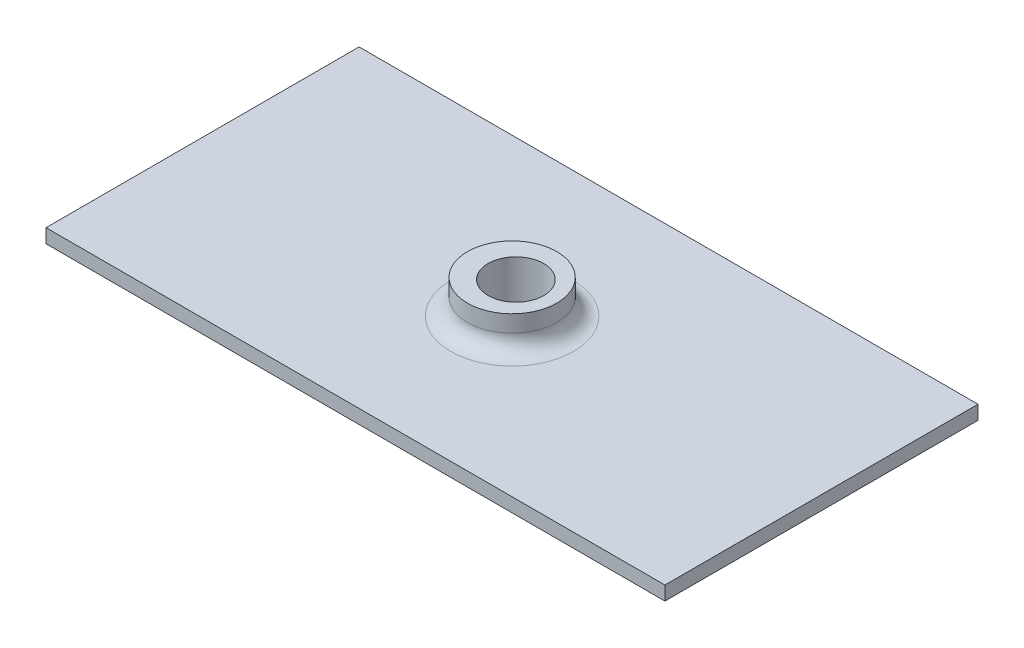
from build123d import *

# Parameters (mm, degrees)
SKETCH1_W                    = 110.9
SKETCH1_H                    = 56.1
SKETCH1_R                    = 8
BOSS_EXTRUDE1_DEPTH          = 2.5
SKETCH1_3_R                  = 8
BOSS_EXTRUDE2_DEPTH          = 8.5
FILLET1_R                    = 3
F_1_8_27_NPSM_TAPPED_HOLE1_D = 9.968


with BuildPart() as part:
    # Sketch1 → Boss-Extrude1 (new body)
    with BuildSketch(Plane(origin=(0, 0, 0), x_dir=(1, 0, 0), z_dir=(0, 1, 0))):
        with Locations((-0.7, 0)):
            Rectangle(SKETCH1_W, SKETCH1_H)
        with Locations(Location((-0.675, 0, 0), (0, 0, 270))):
            Circle(SKETCH1_R, mode=Mode.SUBTRACT)
    extrude(amount=BOSS_EXTRUDE1_DEPTH)

    # Sketch1_3 → Boss-Extrude2 (add)
    with BuildSketch(Plane(origin=(0, 0, 0), x_dir=(1, 0, 0), z_dir=(0, 1, 0))):
        with Locations(Location((-0.675, 0, 0), (0, 0, 270))):
            Circle(SKETCH1_3_R)
    extrude(amount=BOSS_EXTRUDE2_DEPTH)

    # Fillet1
    fillet1_edges = [part.edges().sort_by_distance(p)[0] for p in [
        (-0.675, 2.5, -8),
    ]]
    fillet(fillet1_edges, radius=FILLET1_R)

    # 1_8-27 NPSM Tapped Hole1 (through all)
    with Locations(Plane(origin=(0, 8.5, 0), x_dir=(1, 0, 0), z_dir=(0, 1, 0))):
        with Locations((0, 0)):
            Hole(F_1_8_27_NPSM_TAPPED_HOLE1_D / 2)


solid = part.part
